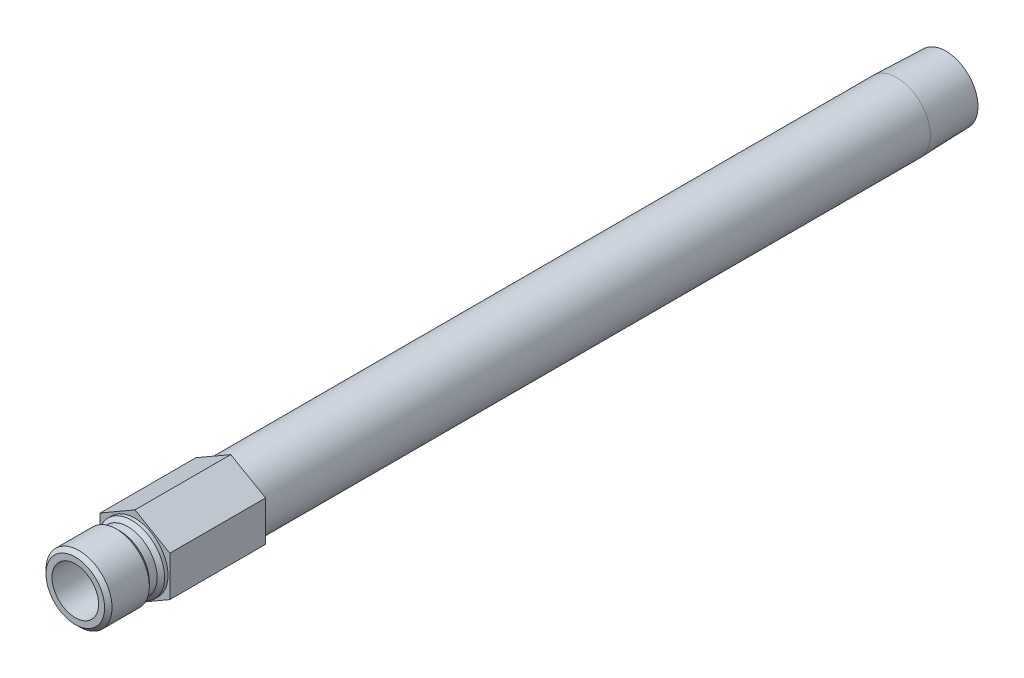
from build123d import *

# Parameters (mm, degrees)
SKETCH2_R           = 4.6228
BOSS_EXTRUDE1_DEPTH = 19.558


with BuildPart() as part:
    # Sketch1 → Revolve1 (revolve)
    with BuildSketch(Plane(origin=(0, 0, 0), x_dir=(0, 0, -1), z_dir=(1, 0, 0))):
        Polygon((-12.192, 4.7625), (-12.192, 5.9817), (-11.43, 6.7437), (-3.81, 6.7437), (-3.048, 5.9817), (-1.4605, 5.9817), (-0.6985, 6.7437), (0, 6.7437), (0, 6.858), (155.575, 6.858), (165.608, 6.544470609), (165.608, 4.6228), (0.074279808, 4.6228), (0, 4.7625), align=None)
    revolve(axis=Axis((0, 0, 0), (0, 0, 1)))

    # Sketch2 → Boss-Extrude1 (add)
    with BuildSketch(Plane.XY):
        Polygon((-7.112, 4.106115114), (-7.112, -4.106115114), (0, -8.212230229), (7.112, -4.106115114), (7.112, 4.106115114), (0, 8.212230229), align=None)
        with Locations(Location((0, 0, 0), (0, 0, 90))):
            Circle(SKETCH2_R, mode=Mode.SUBTRACT)
    extrude(amount=-BOSS_EXTRUDE1_DEPTH)


solid = part.part
